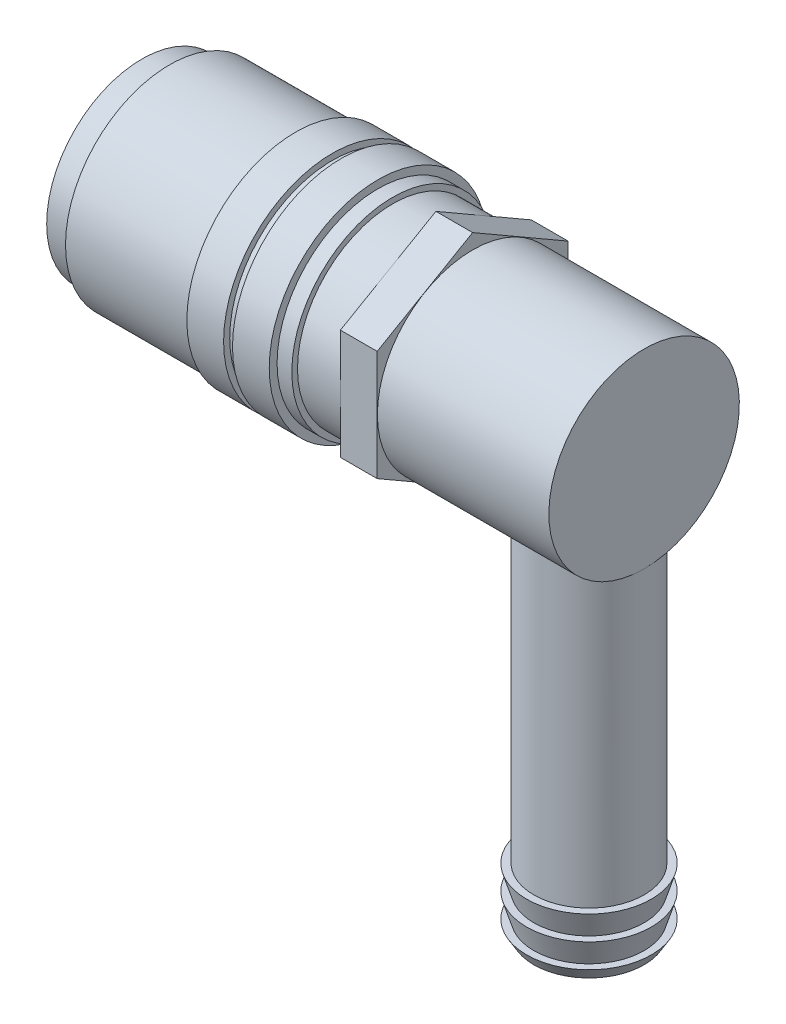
ISO-10303-21;
HEADER;
FILE_DESCRIPTION(('STEP AP214'),'2;1');
FILE_NAME('part.step','',(''),(''),'','','');
FILE_SCHEMA(('AUTOMOTIVE_DESIGN { 1 0 10303 214 1 1 1 1 }'));
ENDSEC;
DATA;
#1=APPLICATION_CONTEXT('core data for automotive mechanical design processes');
#2=APPLICATION_PROTOCOL_DEFINITION('international standard','automotive_design',2000,#1);
#3=PRODUCT_CONTEXT('',#1,'mechanical');
#4=PRODUCT('Part','Part','',(#3));
#5=PRODUCT_RELATED_PRODUCT_CATEGORY('part','',(#4));
#6=PRODUCT_DEFINITION_FORMATION('','',#4);
#7=PRODUCT_DEFINITION_CONTEXT('part definition',#1,'design');
#8=PRODUCT_DEFINITION('design','',#6,#7);
#9=PRODUCT_DEFINITION_SHAPE('','',#8);
#10=(LENGTH_UNIT() NAMED_UNIT(*) SI_UNIT(.MILLI.,.METRE.));
#11=(NAMED_UNIT(*) PLANE_ANGLE_UNIT() SI_UNIT($,.RADIAN.));
#12=(NAMED_UNIT(*) SI_UNIT($,.STERADIAN.) SOLID_ANGLE_UNIT());
#13=UNCERTAINTY_MEASURE_WITH_UNIT(LENGTH_MEASURE(1.E-05),#10,'distance_accuracy_value','');
#14=(GEOMETRIC_REPRESENTATION_CONTEXT(3) GLOBAL_UNCERTAINTY_ASSIGNED_CONTEXT((#13)) GLOBAL_UNIT_ASSIGNED_CONTEXT((#10,
#11,#12)) REPRESENTATION_CONTEXT('',''));
#15=CARTESIAN_POINT('',(0.,0.,0.));
#16=DIRECTION('',(0.,0.,1.));
#17=DIRECTION('',(1.,0.,0.));
#18=AXIS2_PLACEMENT_3D('',#15,#16,#17);
#19=CARTESIAN_POINT('',(41.,0.,0.));
#20=DIRECTION('',(-1.,0.,0.));
#21=DIRECTION('',(0.,0.,1.));
#22=AXIS2_PLACEMENT_3D('',#19,#20,#21);
#23=CYLINDRICAL_SURFACE('',#22,7.77632073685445);
#24=CARTESIAN_POINT('',(27.,0.,0.));
#25=DIRECTION('',(1.,0.,0.));
#26=DIRECTION('',(0.,0.,-1.));
#27=AXIS2_PLACEMENT_3D('',#24,#25,#26);
#28=CIRCLE('',#27,7.77632073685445);
#29=CARTESIAN_POINT('',(27.,0.,-7.77632073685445));
#30=VERTEX_POINT('',#29);
#31=EDGE_CURVE('E172',#30,#30,#28,.T.);
#32=ORIENTED_EDGE('',*,*,#31,.T.);
#33=EDGE_LOOP('',(#32));
#34=FACE_BOUND('',#33,.T.);
#35=CARTESIAN_POINT('',(41.,0.,0.));
#36=DIRECTION('',(1.,0.,0.));
#37=DIRECTION('',(0.,0.,-1.));
#38=AXIS2_PLACEMENT_3D('',#35,#36,#37);
#39=CIRCLE('',#38,7.77632073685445);
#40=CARTESIAN_POINT('',(41.,-7.77632073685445,0.));
#41=VERTEX_POINT('',#40);
#42=EDGE_CURVE('E540',#41,#41,#39,.T.);
#43=ORIENTED_EDGE('',*,*,#42,.F.);
#44=CARTESIAN_POINT('',(41.,-7.77632073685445,0.));
#45=CARTESIAN_POINT('',(40.999998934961,-7.77631977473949,0.115853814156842));
#46=CARTESIAN_POINT('',(40.9955189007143,-7.77372491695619,0.231736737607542));
#47=CARTESIAN_POINT('',(40.9776551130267,-7.76340830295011,0.46263213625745));
#48=CARTESIAN_POINT('',(40.9642662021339,-7.7556835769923,0.577644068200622));
#49=CARTESIAN_POINT('',(40.9287248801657,-7.73527982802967,0.806086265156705));
#50=CARTESIAN_POINT('',(40.9065562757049,-7.72259165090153,0.919513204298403));
#51=CARTESIAN_POINT('',(40.8537448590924,-7.69258051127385,1.14376672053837));
#52=CARTESIAN_POINT('',(40.8230984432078,-7.67525557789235,1.25459217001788));
#53=CARTESIAN_POINT('',(40.7193080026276,-7.61711159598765,1.58089971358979));
#54=CARTESIAN_POINT('',(40.634096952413,-7.56999514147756,1.79156744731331));
#55=CARTESIAN_POINT('',(40.4348503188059,-7.46305401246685,2.19492096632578));
#56=CARTESIAN_POINT('',(40.3208215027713,-7.40323232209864,2.38761095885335));
#57=CARTESIAN_POINT('',(40.0577949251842,-7.27084580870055,2.76566780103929));
#58=CARTESIAN_POINT('',(39.906846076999,-7.19766821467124,2.94946153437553));
#59=CARTESIAN_POINT('',(39.5786013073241,-7.04823240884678,3.29064843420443));
#60=CARTESIAN_POINT('',(39.4012739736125,-6.97197060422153,3.44800964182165));
#61=CARTESIAN_POINT('',(39.0018064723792,-6.81489059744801,3.7497282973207));
#62=CARTESIAN_POINT('',(38.7768709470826,-6.7345204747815,3.89064857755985));
#63=CARTESIAN_POINT('',(38.3018080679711,-6.58915312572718,4.1320927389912));
#64=CARTESIAN_POINT('',(38.051720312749,-6.52413225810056,4.23267891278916));
#65=CARTESIAN_POINT('',(37.5913602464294,-6.43222567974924,4.37068551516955));
#66=CARTESIAN_POINT('',(37.3848899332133,-6.40003924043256,4.41725032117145));
#67=CARTESIAN_POINT('',(36.9654321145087,-6.35566638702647,4.48087479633));
#68=CARTESIAN_POINT('',(36.7524521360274,-6.34345770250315,4.49796732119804));
#69=CARTESIAN_POINT('',(36.3257709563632,-6.34081506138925,4.50169274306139));
#70=CARTESIAN_POINT('',(36.1120691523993,-6.35041383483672,4.48827985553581));
#71=CARTESIAN_POINT('',(35.6905363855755,-6.39001041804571,4.43171154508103));
#72=CARTESIAN_POINT('',(35.4827096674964,-6.42002260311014,4.3885351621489));
#73=CARTESIAN_POINT('',(35.0792815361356,-6.49618983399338,4.27495801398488));
#74=CARTESIAN_POINT('',(34.8836147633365,-6.54224780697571,4.20472069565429));
#75=CARTESIAN_POINT('',(34.506252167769,-6.64553887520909,4.03948570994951));
#76=CARTESIAN_POINT('',(34.3245616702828,-6.70277620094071,3.94447866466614));
#77=CARTESIAN_POINT('',(33.9486873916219,-6.83332750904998,3.71443442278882));
#78=CARTESIAN_POINT('',(33.7573417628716,-6.90773859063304,3.57538753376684));
#79=CARTESIAN_POINT('',(33.3987541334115,-7.05778581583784,3.26922967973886));
#80=CARTESIAN_POINT('',(33.2315335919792,-7.13342298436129,3.10209401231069));
#81=CARTESIAN_POINT('',(32.991963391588,-7.24719145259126,2.82156868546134));
#82=CARTESIAN_POINT('',(32.910210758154,-7.28720070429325,2.71682806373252));
#83=CARTESIAN_POINT('',(32.7558810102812,-7.3644499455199,2.49985575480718));
#84=CARTESIAN_POINT('',(32.6833002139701,-7.4016910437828,2.38762710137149));
#85=CARTESIAN_POINT('',(32.5479662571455,-7.47237623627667,2.15624562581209));
#86=CARTESIAN_POINT('',(32.4852135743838,-7.50582014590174,2.0370924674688));
#87=CARTESIAN_POINT('',(32.3702829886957,-7.56791837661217,1.79266780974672));
#88=CARTESIAN_POINT('',(32.3180986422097,-7.59657561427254,1.66740009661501));
#89=CARTESIAN_POINT('',(32.2281139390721,-7.64649400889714,1.42024662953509));
#90=CARTESIAN_POINT('',(32.1895810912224,-7.66812351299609,1.29870212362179));
#91=CARTESIAN_POINT('',(32.1228383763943,-7.70583864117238,1.05203063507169));
#92=CARTESIAN_POINT('',(32.0946228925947,-7.72192728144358,0.926905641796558));
#93=CARTESIAN_POINT('',(32.0489345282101,-7.74808344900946,0.674164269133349));
#94=CARTESIAN_POINT('',(32.0314551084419,-7.75815464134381,0.546549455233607));
#95=CARTESIAN_POINT('',(32.0075037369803,-7.7719746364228,0.28995603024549));
#96=CARTESIAN_POINT('',(32.0010304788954,-7.77572418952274,0.160977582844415));
#97=CARTESIAN_POINT('',(31.9993113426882,-7.77671945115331,-0.0809010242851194));
#98=CARTESIAN_POINT('',(32.0027606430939,-7.77472102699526,-0.193791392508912));
#99=CARTESIAN_POINT('',(32.0181144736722,-7.76584976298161,-0.418839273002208));
#100=CARTESIAN_POINT('',(32.0300216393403,-7.75897540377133,-0.530996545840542));
#101=CARTESIAN_POINT('',(32.0621385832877,-7.74051704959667,-0.753678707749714));
#102=CARTESIAN_POINT('',(32.0823450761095,-7.72893491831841,-0.864204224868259));
#103=CARTESIAN_POINT('',(32.1308078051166,-7.70133854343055,-1.08292641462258));
#104=CARTESIAN_POINT('',(32.1590671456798,-7.68532259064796,-1.19112217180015));
#105=CARTESIAN_POINT('',(32.2545803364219,-7.63164137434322,-1.5081679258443));
#106=CARTESIAN_POINT('',(32.3330571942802,-7.5880531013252,-1.71276525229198));
#107=CARTESIAN_POINT('',(32.5172147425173,-7.48850898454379,-2.10586441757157));
#108=CARTESIAN_POINT('',(32.6229016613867,-7.43255030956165,-2.2943625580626));
#109=CARTESIAN_POINT('',(32.8708929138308,-7.30609479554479,-2.67125677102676));
#110=CARTESIAN_POINT('',(33.0158663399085,-7.23469044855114,-2.8575926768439));
#111=CARTESIAN_POINT('',(33.3321964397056,-7.08777182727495,-3.2047279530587));
#112=CARTESIAN_POINT('',(33.503583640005,-7.01225286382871,-3.36549733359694));
#113=CARTESIAN_POINT('',(33.8913202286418,-6.85502392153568,-3.67606835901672));
#114=CARTESIAN_POINT('',(34.1105811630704,-6.77361665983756,-3.82241447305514));
#115=CARTESIAN_POINT('',(34.5747839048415,-6.62417161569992,-4.07593509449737));
#116=CARTESIAN_POINT('',(34.8196924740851,-6.5561168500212,-4.18315951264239));
#117=CARTESIAN_POINT('',(35.2748580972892,-6.45631635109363,-4.33515589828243));
#118=CARTESIAN_POINT('',(35.4812592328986,-6.41991149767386,-4.38839523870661));
#119=CARTESIAN_POINT('',(35.9018882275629,-6.36675610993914,-4.4651796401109));
#120=CARTESIAN_POINT('',(36.1161063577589,-6.34998194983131,-4.48876039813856));
#121=CARTESIAN_POINT('',(36.546842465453,-6.33852703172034,-4.50492609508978));
#122=CARTESIAN_POINT('',(36.7633647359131,-6.34389952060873,-4.49743633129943));
#123=CARTESIAN_POINT('',(37.1915683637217,-6.37602791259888,-4.45175932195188));
#124=CARTESIAN_POINT('',(37.4032466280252,-6.40279710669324,-4.41355299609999));
#125=CARTESIAN_POINT('',(37.8110399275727,-6.47306029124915,-4.30980410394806));
#126=CARTESIAN_POINT('',(38.0074092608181,-6.5161282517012,-4.24495453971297));
#127=CARTESIAN_POINT('',(38.3868815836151,-6.61421321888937,-4.09043925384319));
#128=CARTESIAN_POINT('',(38.5699797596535,-6.66923453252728,-4.00076458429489));
#129=CARTESIAN_POINT('',(38.947906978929,-6.79535936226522,-3.78317326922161));
#130=CARTESIAN_POINT('',(39.1401688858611,-6.86763402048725,-3.65148669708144));
#131=CARTESIAN_POINT('',(39.5018206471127,-7.01461013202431,-3.36049976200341));
#132=CARTESIAN_POINT('',(39.6711895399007,-7.08931373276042,-3.20117439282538));
#133=CARTESIAN_POINT('',(39.916377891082,-7.20323911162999,-2.93185345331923));
#134=CARTESIAN_POINT('',(40.0009884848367,-7.2438398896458,-2.8303046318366));
#135=CARTESIAN_POINT('',(40.1613250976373,-7.32267625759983,-2.61958198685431));
#136=CARTESIAN_POINT('',(40.2370544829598,-7.36091274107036,-2.51041107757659));
#137=CARTESIAN_POINT('',(40.3789941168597,-7.43398006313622,-2.28498293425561));
#138=CARTESIAN_POINT('',(40.4452052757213,-7.46881122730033,-2.16872637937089));
#139=CARTESIAN_POINT('',(40.567414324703,-7.53407948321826,-1.9298010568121));
#140=CARTESIAN_POINT('',(40.6234150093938,-7.56451777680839,-1.8071340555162));
#141=CARTESIAN_POINT('',(40.7154800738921,-7.61513208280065,-1.57863161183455));
#142=CARTESIAN_POINT('',(40.753318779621,-7.63617011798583,-1.47369847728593));
#143=CARTESIAN_POINT('',(40.8212559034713,-7.67421811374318,-1.26065135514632));
#144=CARTESIAN_POINT('',(40.8513556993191,-7.69122879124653,-1.1525379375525));
#145=CARTESIAN_POINT('',(40.9034232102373,-7.72080581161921,-0.934049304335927));
#146=CARTESIAN_POINT('',(40.9254100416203,-7.73338259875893,-0.823680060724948));
#147=CARTESIAN_POINT('',(40.9610774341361,-7.75384815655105,-0.601220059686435));
#148=CARTESIAN_POINT('',(40.9747623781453,-7.7617394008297,-0.48913024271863));
#149=CARTESIAN_POINT('',(40.9894696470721,-7.7702307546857,-0.314020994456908));
#150=CARTESIAN_POINT('',(40.9934163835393,-7.77251248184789,-0.251311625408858));
#151=CARTESIAN_POINT('',(40.9986820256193,-7.77555783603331,-0.125737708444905));
#152=CARTESIAN_POINT('',(41.00000057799,-7.77632125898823,-0.0628731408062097));
#153=CARTESIAN_POINT('',(41.,-7.77632073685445,0.));
#154=B_SPLINE_CURVE_WITH_KNOTS('',3,(#44,#45,#46,#47,#48,#49,#50,#51,#52,#53,#54,#55,#56,#57,
#58,#59,#60,#61,#62,#63,#64,#65,#66,#67,#68,#69,#70,#71,#72,#73,#74,#75,#76,#77,#78,#79,#80,#81,
#82,#83,#84,#85,#86,#87,#88,#89,#90,#91,#92,#93,#94,#95,#96,#97,#98,#99,#100,#101,#102,#103,
#104,#105,#106,#107,#108,#109,#110,#111,#112,#113,#114,#115,#116,#117,#118,#119,#120,#121,#122,
#123,#124,#125,#126,#127,#128,#129,#130,#131,#132,#133,#134,#135,#136,#137,#138,#139,#140,#141,
#142,#143,#144,#145,#146,#147,#148,#149,#150,#151,#152,#153),.UNSPECIFIED.,.T.,.F.,(4,2,2,2,2,2,
2,2,2,2,2,2,2,2,2,2,2,2,2,2,2,2,2,2,2,2,2,2,2,2,2,2,2,2,2,2,2,2,2,2,2,2,2,2,2,2,2,2,2,2,2,2,2,2,
4),(0.,0.347496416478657,0.695194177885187,1.04353624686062,1.39202661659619,2.08492763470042,
2.77766608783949,3.52120228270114,4.2656310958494,5.09354091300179,5.92016712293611,
6.55967357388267,7.19846664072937,7.83821908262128,8.4784225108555,9.1148182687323,
9.75145531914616,10.4925049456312,11.2342097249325,11.650043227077,12.0657092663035,
12.4813955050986,12.8968275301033,13.2842554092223,13.6714720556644,14.0584526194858,
14.4453872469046,14.7838526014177,15.1224234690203,15.4608604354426,15.7994280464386,
16.4666722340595,17.1340692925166,17.8710580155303,18.6089049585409,19.4326468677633,
20.2553341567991,20.9013173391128,21.5465222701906,22.1932793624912,22.8404385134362,
23.4717349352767,24.1032591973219,24.8324799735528,25.5623639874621,25.9767457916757,
26.3909700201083,26.8051546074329,27.2192256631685,27.5594112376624,27.8995362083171,
28.2388545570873,28.577993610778,28.7665524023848,28.9551365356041),.UNSPECIFIED.);
#155=EDGE_CURVE('E29',#41,#41,#154,.T.);
#156=ORIENTED_EDGE('',*,*,#155,.F.);
#157=EDGE_LOOP('',(#43,#156));
#158=FACE_BOUND('',#157,.T.);
#159=ADVANCED_FACE('F15',(#34,#158),#23,.T.);
#160=CARTESIAN_POINT('',(0.,0.,0.));
#161=DIRECTION('',(-1.,0.,0.));
#162=DIRECTION('',(0.,0.,1.));
#163=AXIS2_PLACEMENT_3D('',#160,#161,#162);
#164=CYLINDRICAL_SURFACE('',#163,7.77632073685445);
#165=CARTESIAN_POINT('',(0.,0.,0.));
#166=DIRECTION('',(-1.,0.,0.));
#167=DIRECTION('',(0.,0.,1.));
#168=AXIS2_PLACEMENT_3D('',#165,#166,#167);
#169=CIRCLE('',#168,7.77632073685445);
#170=CARTESIAN_POINT('',(0.,0.,7.77632073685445));
#171=VERTEX_POINT('',#170);
#172=EDGE_CURVE('E170',#171,#171,#169,.T.);
#173=ORIENTED_EDGE('',*,*,#172,.F.);
#174=EDGE_LOOP('',(#173));
#175=FACE_BOUND('',#174,.T.);
#176=CARTESIAN_POINT('',(2.26082941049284,0.,0.));
#177=DIRECTION('',(-1.,0.,0.));
#178=DIRECTION('',(0.,0.,1.));
#179=AXIS2_PLACEMENT_3D('',#176,#177,#178);
#180=CIRCLE('',#179,7.77632073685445);
#181=CARTESIAN_POINT('',(2.26082941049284,0.,7.77632073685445));
#182=VERTEX_POINT('',#181);
#183=EDGE_CURVE('E129',#182,#182,#180,.T.);
#184=ORIENTED_EDGE('',*,*,#183,.T.);
#185=EDGE_LOOP('',(#184));
#186=FACE_BOUND('',#185,.T.);
#187=ADVANCED_FACE('F17',(#175,#186),#164,.T.);
#188=CARTESIAN_POINT('',(0.,4.75,0.));
#189=DIRECTION('',(1.,0.,0.));
#190=DIRECTION('',(0.,0.,-1.));
#191=AXIS2_PLACEMENT_3D('',#188,#189,#190);
#192=PLANE('',#191);
#193=CARTESIAN_POINT('',(0.,0.,0.));
#194=DIRECTION('',(-1.,0.,0.));
#195=DIRECTION('',(0.,0.,1.));
#196=AXIS2_PLACEMENT_3D('',#193,#194,#195);
#197=CIRCLE('',#196,4.75);
#198=CARTESIAN_POINT('',(0.,0.,4.75));
#199=VERTEX_POINT('',#198);
#200=EDGE_CURVE('E165',#199,#199,#197,.T.);
#201=ORIENTED_EDGE('',*,*,#200,.F.);
#202=EDGE_LOOP('',(#201));
#203=FACE_BOUND('',#202,.T.);
#204=ORIENTED_EDGE('',*,*,#172,.T.);
#205=EDGE_LOOP('',(#204));
#206=FACE_BOUND('',#205,.T.);
#207=ADVANCED_FACE('F237',(#203,#206),#192,.F.);
#208=CARTESIAN_POINT('',(0.,0.,0.));
#209=DIRECTION('',(-1.,0.,0.));
#210=DIRECTION('',(0.,0.,1.));
#211=AXIS2_PLACEMENT_3D('',#208,#209,#210);
#212=CYLINDRICAL_SURFACE('',#211,4.75);
#213=ORIENTED_EDGE('',*,*,#200,.T.);
#214=EDGE_LOOP('',(#213));
#215=FACE_BOUND('',#214,.T.);
#216=CARTESIAN_POINT('',(27.,0.,0.));
#217=DIRECTION('',(1.,0.,0.));
#218=DIRECTION('',(0.,0.,-1.));
#219=AXIS2_PLACEMENT_3D('',#216,#217,#218);
#220=CIRCLE('',#219,4.75);
#221=CARTESIAN_POINT('',(27.,0.,-4.75));
#222=VERTEX_POINT('',#221);
#223=EDGE_CURVE('E112',#222,#222,#220,.T.);
#224=ORIENTED_EDGE('',*,*,#223,.T.);
#225=EDGE_LOOP('',(#224));
#226=FACE_BOUND('',#225,.T.);
#227=ADVANCED_FACE('F329',(#215,#226),#212,.F.);
#228=CARTESIAN_POINT('',(0.,0.,0.));
#229=DIRECTION('',(-1.,0.,0.));
#230=DIRECTION('',(0.,0.,1.));
#231=AXIS2_PLACEMENT_3D('',#228,#229,#230);
#232=CYLINDRICAL_SURFACE('',#231,7.77632073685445);
#233=CARTESIAN_POINT('',(20.4767230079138,0.,0.));
#234=DIRECTION('',(-1.,0.,0.));
#235=DIRECTION('',(0.,0.,1.));
#236=AXIS2_PLACEMENT_3D('',#233,#234,#235);
#237=CIRCLE('',#236,7.77632073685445);
#238=CARTESIAN_POINT('',(20.4767230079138,0.,7.77632073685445));
#239=VERTEX_POINT('',#238);
#240=EDGE_CURVE('E162',#239,#239,#237,.T.);
#241=ORIENTED_EDGE('',*,*,#240,.F.);
#242=EDGE_LOOP('',(#241));
#243=FACE_BOUND('',#242,.T.);
#244=CARTESIAN_POINT('',(24.,0.,0.));
#245=DIRECTION('',(-1.,0.,0.));
#246=DIRECTION('',(0.,0.,1.));
#247=AXIS2_PLACEMENT_3D('',#244,#245,#246);
#248=CIRCLE('',#247,7.77632073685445);
#249=CARTESIAN_POINT('',(24.,0.,7.77632073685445));
#250=VERTEX_POINT('',#249);
#251=EDGE_CURVE('E128',#250,#250,#248,.T.);
#252=ORIENTED_EDGE('',*,*,#251,.T.);
#253=EDGE_LOOP('',(#252));
#254=FACE_BOUND('',#253,.T.);
#255=ADVANCED_FACE('F336',(#243,#254),#232,.T.);
#256=CARTESIAN_POINT('',(20.4767230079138,8.23838165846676,0.));
#257=DIRECTION('',(-1.,0.,0.));
#258=DIRECTION('',(0.,0.,1.));
#259=AXIS2_PLACEMENT_3D('',#256,#257,#258);
#260=PLANE('',#259);
#261=CARTESIAN_POINT('',(20.4767230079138,0.,0.));
#262=DIRECTION('',(-1.,0.,0.));
#263=DIRECTION('',(0.,0.,1.));
#264=AXIS2_PLACEMENT_3D('',#261,#262,#263);
#265=CIRCLE('',#264,8.23838165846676);
#266=CARTESIAN_POINT('',(20.4767230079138,0.,8.23838165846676));
#267=VERTEX_POINT('',#266);
#268=EDGE_CURVE('E159',#267,#267,#265,.T.);
#269=ORIENTED_EDGE('',*,*,#268,.F.);
#270=EDGE_LOOP('',(#269));
#271=FACE_BOUND('',#270,.T.);
#272=ORIENTED_EDGE('',*,*,#240,.T.);
#273=EDGE_LOOP('',(#272));
#274=FACE_BOUND('',#273,.T.);
#275=ADVANCED_FACE('F345',(#271,#274),#260,.F.);
#276=CARTESIAN_POINT('',(0.,0.,0.));
#277=DIRECTION('',(-1.,0.,0.));
#278=DIRECTION('',(0.,0.,1.));
#279=AXIS2_PLACEMENT_3D('',#276,#277,#278);
#280=CYLINDRICAL_SURFACE('',#279,8.23838165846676);
#281=CARTESIAN_POINT('',(19.2715238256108,0.,0.));
#282=DIRECTION('',(-1.,0.,0.));
#283=DIRECTION('',(0.,0.,1.));
#284=AXIS2_PLACEMENT_3D('',#281,#282,#283);
#285=CIRCLE('',#284,8.23838165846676);
#286=CARTESIAN_POINT('',(19.2715238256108,0.,8.23838165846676));
#287=VERTEX_POINT('',#286);
#288=EDGE_CURVE('E156',#287,#287,#285,.T.);
#289=ORIENTED_EDGE('',*,*,#288,.F.);
#290=EDGE_LOOP('',(#289));
#291=FACE_BOUND('',#290,.T.);
#292=ORIENTED_EDGE('',*,*,#268,.T.);
#293=EDGE_LOOP('',(#292));
#294=FACE_BOUND('',#293,.T.);
#295=ADVANCED_FACE('F354',(#291,#294),#280,.T.);
#296=CARTESIAN_POINT('',(19.2715238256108,8.8782970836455,0.));
#297=DIRECTION('',(-1.,0.,0.));
#298=DIRECTION('',(0.,0.,1.));
#299=AXIS2_PLACEMENT_3D('',#296,#297,#298);
#300=PLANE('',#299);
#301=CARTESIAN_POINT('',(19.2715238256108,0.,0.));
#302=DIRECTION('',(-1.,0.,0.));
#303=DIRECTION('',(0.,0.,1.));
#304=AXIS2_PLACEMENT_3D('',#301,#302,#303);
#305=CIRCLE('',#304,8.8782970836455);
#306=CARTESIAN_POINT('',(19.2715238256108,0.,8.8782970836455));
#307=VERTEX_POINT('',#306);
#308=EDGE_CURVE('E153',#307,#307,#305,.T.);
#309=ORIENTED_EDGE('',*,*,#308,.F.);
#310=EDGE_LOOP('',(#309));
#311=FACE_BOUND('',#310,.T.);
#312=ORIENTED_EDGE('',*,*,#288,.T.);
#313=EDGE_LOOP('',(#312));
#314=FACE_BOUND('',#313,.T.);
#315=ADVANCED_FACE('F363',(#311,#314),#300,.F.);
#316=CARTESIAN_POINT('',(0.,0.,0.));
#317=DIRECTION('',(-1.,0.,0.));
#318=DIRECTION('',(0.,0.,1.));
#319=AXIS2_PLACEMENT_3D('',#316,#317,#318);
#320=CYLINDRICAL_SURFACE('',#319,8.8782970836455);
#321=CARTESIAN_POINT('',(16.2715238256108,0.,0.));
#322=DIRECTION('',(-1.,0.,0.));
#323=DIRECTION('',(0.,0.,1.));
#324=AXIS2_PLACEMENT_3D('',#321,#322,#323);
#325=CIRCLE('',#324,8.8782970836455);
#326=CARTESIAN_POINT('',(16.2715238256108,0.,8.8782970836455));
#327=VERTEX_POINT('',#326);
#328=EDGE_CURVE('E150',#327,#327,#325,.T.);
#329=ORIENTED_EDGE('',*,*,#328,.F.);
#330=EDGE_LOOP('',(#329));
#331=FACE_BOUND('',#330,.T.);
#332=ORIENTED_EDGE('',*,*,#308,.T.);
#333=EDGE_LOOP('',(#332));
#334=FACE_BOUND('',#333,.T.);
#335=ADVANCED_FACE('F372',(#331,#334),#320,.T.);
#336=CARTESIAN_POINT('',(16.2715238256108,8.3782970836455,0.));
#337=DIRECTION('',(1.,0.,0.));
#338=DIRECTION('',(0.,0.,-1.));
#339=AXIS2_PLACEMENT_3D('',#336,#337,#338);
#340=PLANE('',#339);
#341=CARTESIAN_POINT('',(16.2715238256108,0.,0.));
#342=DIRECTION('',(-1.,0.,0.));
#343=DIRECTION('',(0.,0.,1.));
#344=AXIS2_PLACEMENT_3D('',#341,#342,#343);
#345=CIRCLE('',#344,8.3782970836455);
#346=CARTESIAN_POINT('',(16.2715238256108,0.,8.3782970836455));
#347=VERTEX_POINT('',#346);
#348=EDGE_CURVE('E147',#347,#347,#345,.T.);
#349=ORIENTED_EDGE('',*,*,#348,.F.);
#350=EDGE_LOOP('',(#349));
#351=FACE_BOUND('',#350,.T.);
#352=ORIENTED_EDGE('',*,*,#328,.T.);
#353=EDGE_LOOP('',(#352));
#354=FACE_BOUND('',#353,.T.);
#355=ADVANCED_FACE('F381',(#351,#354),#340,.F.);
#356=CARTESIAN_POINT('',(0.,0.,0.));
#357=DIRECTION('',(-1.,0.,0.));
#358=DIRECTION('',(0.,0.,1.));
#359=AXIS2_PLACEMENT_3D('',#356,#357,#358);
#360=CYLINDRICAL_SURFACE('',#359,8.3782970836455);
#361=CARTESIAN_POINT('',(15.5455682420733,0.,0.));
#362=DIRECTION('',(-1.,0.,0.));
#363=DIRECTION('',(0.,0.,1.));
#364=AXIS2_PLACEMENT_3D('',#361,#362,#363);
#365=CIRCLE('',#364,8.3782970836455);
#366=CARTESIAN_POINT('',(15.5455682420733,0.,8.3782970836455));
#367=VERTEX_POINT('',#366);
#368=EDGE_CURVE('E144',#367,#367,#365,.T.);
#369=ORIENTED_EDGE('',*,*,#368,.F.);
#370=EDGE_LOOP('',(#369));
#371=FACE_BOUND('',#370,.T.);
#372=ORIENTED_EDGE('',*,*,#348,.T.);
#373=EDGE_LOOP('',(#372));
#374=FACE_BOUND('',#373,.T.);
#375=ADVANCED_FACE('F390',(#371,#374),#360,.T.);
#376=CARTESIAN_POINT('',(15.5455682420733,8.8782970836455,0.));
#377=DIRECTION('',(-1.,0.,0.));
#378=DIRECTION('',(0.,0.,1.));
#379=AXIS2_PLACEMENT_3D('',#376,#377,#378);
#380=PLANE('',#379);
#381=CARTESIAN_POINT('',(15.5455682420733,0.,0.));
#382=DIRECTION('',(-1.,0.,0.));
#383=DIRECTION('',(0.,0.,1.));
#384=AXIS2_PLACEMENT_3D('',#381,#382,#383);
#385=CIRCLE('',#384,8.8782970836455);
#386=CARTESIAN_POINT('',(15.5455682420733,0.,8.8782970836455));
#387=VERTEX_POINT('',#386);
#388=EDGE_CURVE('E141',#387,#387,#385,.T.);
#389=ORIENTED_EDGE('',*,*,#388,.F.);
#390=EDGE_LOOP('',(#389));
#391=FACE_BOUND('',#390,.T.);
#392=ORIENTED_EDGE('',*,*,#368,.T.);
#393=EDGE_LOOP('',(#392));
#394=FACE_BOUND('',#393,.T.);
#395=ADVANCED_FACE('F399',(#391,#394),#380,.F.);
#396=CARTESIAN_POINT('',(0.,0.,0.));
#397=DIRECTION('',(-1.,0.,0.));
#398=DIRECTION('',(0.,0.,1.));
#399=AXIS2_PLACEMENT_3D('',#396,#397,#398);
#400=CYLINDRICAL_SURFACE('',#399,8.8782970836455);
#401=CARTESIAN_POINT('',(12.5455682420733,0.,0.));
#402=DIRECTION('',(-1.,0.,0.));
#403=DIRECTION('',(0.,0.,1.));
#404=AXIS2_PLACEMENT_3D('',#401,#402,#403);
#405=CIRCLE('',#404,8.8782970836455);
#406=CARTESIAN_POINT('',(12.5455682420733,0.,8.8782970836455));
#407=VERTEX_POINT('',#406);
#408=EDGE_CURVE('E138',#407,#407,#405,.T.);
#409=ORIENTED_EDGE('',*,*,#408,.F.);
#410=EDGE_LOOP('',(#409));
#411=FACE_BOUND('',#410,.T.);
#412=ORIENTED_EDGE('',*,*,#388,.T.);
#413=EDGE_LOOP('',(#412));
#414=FACE_BOUND('',#413,.T.);
#415=ADVANCED_FACE('F408',(#411,#414),#400,.T.);
#416=CARTESIAN_POINT('',(12.5455682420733,8.5,0.));
#417=DIRECTION('',(1.,0.,0.));
#418=DIRECTION('',(0.,0.,-1.));
#419=AXIS2_PLACEMENT_3D('',#416,#417,#418);
#420=PLANE('',#419);
#421=CARTESIAN_POINT('',(12.5455682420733,0.,0.));
#422=DIRECTION('',(-1.,0.,0.));
#423=DIRECTION('',(0.,0.,1.));
#424=AXIS2_PLACEMENT_3D('',#421,#422,#423);
#425=CIRCLE('',#424,8.5);
#426=CARTESIAN_POINT('',(12.5455682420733,0.,8.5));
#427=VERTEX_POINT('',#426);
#428=EDGE_CURVE('E135',#427,#427,#425,.T.);
#429=ORIENTED_EDGE('',*,*,#428,.F.);
#430=EDGE_LOOP('',(#429));
#431=FACE_BOUND('',#430,.T.);
#432=ORIENTED_EDGE('',*,*,#408,.T.);
#433=EDGE_LOOP('',(#432));
#434=FACE_BOUND('',#433,.T.);
#435=ADVANCED_FACE('F417',(#431,#434),#420,.F.);
#436=CARTESIAN_POINT('',(0.,0.,0.));
#437=DIRECTION('',(-1.,0.,0.));
#438=DIRECTION('',(0.,0.,1.));
#439=AXIS2_PLACEMENT_3D('',#436,#437,#438);
#440=CYLINDRICAL_SURFACE('',#439,8.5);
#441=CARTESIAN_POINT('',(2.26082941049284,0.,0.));
#442=DIRECTION('',(-1.,0.,0.));
#443=DIRECTION('',(0.,0.,1.));
#444=AXIS2_PLACEMENT_3D('',#441,#442,#443);
#445=CIRCLE('',#444,8.5);
#446=CARTESIAN_POINT('',(2.26082941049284,0.,8.5));
#447=VERTEX_POINT('',#446);
#448=EDGE_CURVE('E132',#447,#447,#445,.T.);
#449=ORIENTED_EDGE('',*,*,#448,.F.);
#450=EDGE_LOOP('',(#449));
#451=FACE_BOUND('',#450,.T.);
#452=ORIENTED_EDGE('',*,*,#428,.T.);
#453=EDGE_LOOP('',(#452));
#454=FACE_BOUND('',#453,.T.);
#455=ADVANCED_FACE('F426',(#451,#454),#440,.T.);
#456=CARTESIAN_POINT('',(2.26082941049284,7.77632073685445,0.));
#457=DIRECTION('',(1.,0.,0.));
#458=DIRECTION('',(0.,0.,-1.));
#459=AXIS2_PLACEMENT_3D('',#456,#457,#458);
#460=PLANE('',#459);
#461=ORIENTED_EDGE('',*,*,#183,.F.);
#462=EDGE_LOOP('',(#461));
#463=FACE_BOUND('',#462,.T.);
#464=ORIENTED_EDGE('',*,*,#448,.T.);
#465=EDGE_LOOP('',(#464));
#466=FACE_BOUND('',#465,.T.);
#467=ADVANCED_FACE('F435',(#463,#466),#460,.F.);
#468=CARTESIAN_POINT('',(27.,0.,0.));
#469=DIRECTION('',(1.,0.,0.));
#470=DIRECTION('',(0.,0.,-1.));
#471=AXIS2_PLACEMENT_3D('',#468,#469,#470);
#472=PLANE('',#471);
#473=ORIENTED_EDGE('',*,*,#31,.F.);
#474=EDGE_LOOP('',(#473));
#475=FACE_BOUND('',#474,.T.);
#476=DIRECTION('',(0.,0.5,0.866025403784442));
#477=VECTOR('',#476,1.);
#478=CARTESIAN_POINT('',(27.,4.50000000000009,-7.7942286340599));
#479=LINE('',#478,#477);
#480=CARTESIAN_POINT('',(27.,4.50000000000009,-7.7942286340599));
#481=VERTEX_POINT('',#480);
#482=CARTESIAN_POINT('',(27.,9.,0.));
#483=VERTEX_POINT('',#482);
#484=EDGE_CURVE('E119',#481,#483,#479,.T.);
#485=ORIENTED_EDGE('',*,*,#484,.T.);
#486=DIRECTION('',(0.,-0.5,0.866025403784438));
#487=VECTOR('',#486,1.);
#488=CARTESIAN_POINT('',(27.,9.,0.));
#489=LINE('',#488,#487);
#490=CARTESIAN_POINT('',(27.,4.5,7.79422863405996));
#491=VERTEX_POINT('',#490);
#492=EDGE_CURVE('E76',#483,#491,#489,.T.);
#493=ORIENTED_EDGE('',*,*,#492,.T.);
#494=DIRECTION('',(0.,-1.,0.));
#495=VECTOR('',#494,1.);
#496=CARTESIAN_POINT('',(27.,4.5,7.79422863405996));
#497=LINE('',#496,#495);
#498=CARTESIAN_POINT('',(27.,-4.5,7.79422863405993));
#499=VERTEX_POINT('',#498);
#500=EDGE_CURVE('E90',#491,#499,#497,.T.);
#501=ORIENTED_EDGE('',*,*,#500,.T.);
#502=DIRECTION('',(0.,-0.5,-0.866025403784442));
#503=VECTOR('',#502,1.);
#504=CARTESIAN_POINT('',(27.,-4.5,7.79422863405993));
#505=LINE('',#504,#503);
#506=CARTESIAN_POINT('',(27.,-9.,0.));
#507=VERTEX_POINT('',#506);
#508=EDGE_CURVE('E84',#499,#507,#505,.T.);
#509=ORIENTED_EDGE('',*,*,#508,.T.);
#510=DIRECTION('',(0.,0.500000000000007,-0.866025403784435));
#511=VECTOR('',#510,1.);
#512=CARTESIAN_POINT('',(27.,-9.,0.));
#513=LINE('',#512,#511);
#514=CARTESIAN_POINT('',(27.,-4.49999999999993,-7.79422863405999));
#515=VERTEX_POINT('',#514);
#516=EDGE_CURVE('E88',#507,#515,#513,.T.);
#517=ORIENTED_EDGE('',*,*,#516,.T.);
#518=DIRECTION('',(0.,1.,0.));
#519=VECTOR('',#518,1.);
#520=CARTESIAN_POINT('',(27.,-4.49999999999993,-7.79422863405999));
#521=LINE('',#520,#519);
#522=EDGE_CURVE('E37',#515,#481,#521,.T.);
#523=ORIENTED_EDGE('',*,*,#522,.T.);
#524=EDGE_LOOP('',(#485,#493,#501,#509,#517,#523));
#525=FACE_BOUND('',#524,.T.);
#526=ADVANCED_FACE('F86',(#475,#525),#472,.T.);
#527=CARTESIAN_POINT('',(24.,0.,0.));
#528=DIRECTION('',(1.,0.,0.));
#529=DIRECTION('',(0.,0.,-1.));
#530=AXIS2_PLACEMENT_3D('',#527,#528,#529);
#531=PLANE('',#530);
#532=ORIENTED_EDGE('',*,*,#251,.F.);
#533=EDGE_LOOP('',(#532));
#534=FACE_BOUND('',#533,.T.);
#535=DIRECTION('',(0.,0.5,0.866025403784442));
#536=VECTOR('',#535,1.);
#537=CARTESIAN_POINT('',(24.,4.50000000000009,-7.7942286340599));
#538=LINE('',#537,#536);
#539=CARTESIAN_POINT('',(24.,4.50000000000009,-7.7942286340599));
#540=VERTEX_POINT('',#539);
#541=CARTESIAN_POINT('',(24.,9.,0.));
#542=VERTEX_POINT('',#541);
#543=EDGE_CURVE('E108',#540,#542,#538,.T.);
#544=ORIENTED_EDGE('',*,*,#543,.F.);
#545=DIRECTION('',(0.,1.,0.));
#546=VECTOR('',#545,1.);
#547=CARTESIAN_POINT('',(24.,-4.49999999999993,-7.79422863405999));
#548=LINE('',#547,#546);
#549=CARTESIAN_POINT('',(24.,-4.49999999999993,-7.79422863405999));
#550=VERTEX_POINT('',#549);
#551=EDGE_CURVE('E67',#550,#540,#548,.T.);
#552=ORIENTED_EDGE('',*,*,#551,.F.);
#553=DIRECTION('',(0.,0.500000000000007,-0.866025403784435));
#554=VECTOR('',#553,1.);
#555=CARTESIAN_POINT('',(24.,-9.,0.));
#556=LINE('',#555,#554);
#557=CARTESIAN_POINT('',(24.,-9.,0.));
#558=VERTEX_POINT('',#557);
#559=EDGE_CURVE('E61',#558,#550,#556,.T.);
#560=ORIENTED_EDGE('',*,*,#559,.F.);
#561=DIRECTION('',(0.,-0.5,-0.866025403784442));
#562=VECTOR('',#561,1.);
#563=CARTESIAN_POINT('',(24.,-4.5,7.79422863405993));
#564=LINE('',#563,#562);
#565=CARTESIAN_POINT('',(24.,-4.5,7.79422863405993));
#566=VERTEX_POINT('',#565);
#567=EDGE_CURVE('E98',#566,#558,#564,.T.);
#568=ORIENTED_EDGE('',*,*,#567,.F.);
#569=DIRECTION('',(0.,-1.,0.));
#570=VECTOR('',#569,1.);
#571=CARTESIAN_POINT('',(24.,4.5,7.79422863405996));
#572=LINE('',#571,#570);
#573=CARTESIAN_POINT('',(24.,4.5,7.79422863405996));
#574=VERTEX_POINT('',#573);
#575=EDGE_CURVE('E114',#574,#566,#572,.T.);
#576=ORIENTED_EDGE('',*,*,#575,.F.);
#577=DIRECTION('',(0.,-0.5,0.866025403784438));
#578=VECTOR('',#577,1.);
#579=CARTESIAN_POINT('',(24.,9.,0.));
#580=LINE('',#579,#578);
#581=EDGE_CURVE('E111',#542,#574,#580,.T.);
#582=ORIENTED_EDGE('',*,*,#581,.F.);
#583=EDGE_LOOP('',(#544,#552,#560,#568,#576,#582));
#584=FACE_BOUND('',#583,.T.);
#585=ADVANCED_FACE('F452',(#534,#584),#531,.F.);
#586=CARTESIAN_POINT('',(27.,4.50000000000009,-7.7942286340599));
#587=DIRECTION('',(0.,-0.866025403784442,0.5));
#588=DIRECTION('',(0.,-0.5,-0.866025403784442));
#589=AXIS2_PLACEMENT_3D('',#586,#587,#588);
#590=PLANE('',#589);
#591=ORIENTED_EDGE('',*,*,#543,.T.);
#592=DIRECTION('',(-1.,0.,0.));
#593=VECTOR('',#592,1.);
#594=CARTESIAN_POINT('',(27.,9.,0.));
#595=LINE('',#594,#593);
#596=EDGE_CURVE('E126',#483,#542,#595,.T.);
#597=ORIENTED_EDGE('',*,*,#596,.F.);
#598=ORIENTED_EDGE('',*,*,#484,.F.);
#599=DIRECTION('',(-1.,0.,0.));
#600=VECTOR('',#599,1.);
#601=CARTESIAN_POINT('',(27.,4.50000000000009,-7.7942286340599));
#602=LINE('',#601,#600);
#603=EDGE_CURVE('E104',#481,#540,#602,.T.);
#604=ORIENTED_EDGE('',*,*,#603,.T.);
#605=EDGE_LOOP('',(#591,#597,#598,#604));
#606=FACE_BOUND('',#605,.T.);
#607=ADVANCED_FACE('F460',(#606),#590,.F.);
#608=CARTESIAN_POINT('',(27.,9.,0.));
#609=DIRECTION('',(0.,-0.866025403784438,-0.5));
#610=DIRECTION('',(0.,0.5,-0.866025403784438));
#611=AXIS2_PLACEMENT_3D('',#608,#609,#610);
#612=PLANE('',#611);
#613=ORIENTED_EDGE('',*,*,#581,.T.);
#614=DIRECTION('',(-1.,0.,0.));
#615=VECTOR('',#614,1.);
#616=CARTESIAN_POINT('',(27.,4.5,7.79422863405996));
#617=LINE('',#616,#615);
#618=EDGE_CURVE('E123',#491,#574,#617,.T.);
#619=ORIENTED_EDGE('',*,*,#618,.F.);
#620=ORIENTED_EDGE('',*,*,#492,.F.);
#621=ORIENTED_EDGE('',*,*,#596,.T.);
#622=EDGE_LOOP('',(#613,#619,#620,#621));
#623=FACE_BOUND('',#622,.T.);
#624=ADVANCED_FACE('F469',(#623),#612,.F.);
#625=CARTESIAN_POINT('',(27.,4.5,7.79422863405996));
#626=DIRECTION('',(0.,0.,-1.));
#627=DIRECTION('',(0.,1.,0.));
#628=AXIS2_PLACEMENT_3D('',#625,#626,#627);
#629=PLANE('',#628);
#630=ORIENTED_EDGE('',*,*,#575,.T.);
#631=DIRECTION('',(-1.,0.,0.));
#632=VECTOR('',#631,1.);
#633=CARTESIAN_POINT('',(27.,-4.5,7.79422863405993));
#634=LINE('',#633,#632);
#635=EDGE_CURVE('E99',#499,#566,#634,.T.);
#636=ORIENTED_EDGE('',*,*,#635,.F.);
#637=ORIENTED_EDGE('',*,*,#500,.F.);
#638=ORIENTED_EDGE('',*,*,#618,.T.);
#639=EDGE_LOOP('',(#630,#636,#637,#638));
#640=FACE_BOUND('',#639,.T.);
#641=ADVANCED_FACE('F478',(#640),#629,.F.);
#642=CARTESIAN_POINT('',(27.,-4.5,7.79422863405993));
#643=DIRECTION('',(0.,0.866025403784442,-0.5));
#644=DIRECTION('',(0.,0.5,0.866025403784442));
#645=AXIS2_PLACEMENT_3D('',#642,#643,#644);
#646=PLANE('',#645);
#647=ORIENTED_EDGE('',*,*,#567,.T.);
#648=DIRECTION('',(-1.,0.,0.));
#649=VECTOR('',#648,1.);
#650=CARTESIAN_POINT('',(27.,-9.,0.));
#651=LINE('',#650,#649);
#652=EDGE_CURVE('E95',#507,#558,#651,.T.);
#653=ORIENTED_EDGE('',*,*,#652,.F.);
#654=ORIENTED_EDGE('',*,*,#508,.F.);
#655=ORIENTED_EDGE('',*,*,#635,.T.);
#656=EDGE_LOOP('',(#647,#653,#654,#655));
#657=FACE_BOUND('',#656,.T.);
#658=ADVANCED_FACE('F96',(#657),#646,.F.);
#659=CARTESIAN_POINT('',(27.,-9.,0.));
#660=DIRECTION('',(0.,0.866025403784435,0.500000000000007));
#661=DIRECTION('',(0.,-0.500000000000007,0.866025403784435));
#662=AXIS2_PLACEMENT_3D('',#659,#660,#661);
#663=PLANE('',#662);
#664=ORIENTED_EDGE('',*,*,#559,.T.);
#665=DIRECTION('',(-1.,0.,0.));
#666=VECTOR('',#665,1.);
#667=CARTESIAN_POINT('',(27.,-4.49999999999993,-7.79422863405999));
#668=LINE('',#667,#666);
#669=EDGE_CURVE('E100',#515,#550,#668,.T.);
#670=ORIENTED_EDGE('',*,*,#669,.F.);
#671=ORIENTED_EDGE('',*,*,#516,.F.);
#672=ORIENTED_EDGE('',*,*,#652,.T.);
#673=EDGE_LOOP('',(#664,#670,#671,#672));
#674=FACE_BOUND('',#673,.T.);
#675=ADVANCED_FACE('F102',(#674),#663,.F.);
#676=CARTESIAN_POINT('',(27.,-4.49999999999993,-7.79422863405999));
#677=DIRECTION('',(0.,0.,1.));
#678=DIRECTION('',(0.,-1.,0.));
#679=AXIS2_PLACEMENT_3D('',#676,#677,#678);
#680=PLANE('',#679);
#681=ORIENTED_EDGE('',*,*,#551,.T.);
#682=ORIENTED_EDGE('',*,*,#603,.F.);
#683=ORIENTED_EDGE('',*,*,#522,.F.);
#684=ORIENTED_EDGE('',*,*,#669,.T.);
#685=EDGE_LOOP('',(#681,#682,#683,#684));
#686=FACE_BOUND('',#685,.T.);
#687=ADVANCED_FACE('F222',(#686),#680,.F.);
#688=CARTESIAN_POINT('',(41.,0.,0.));
#689=DIRECTION('',(1.,0.,0.));
#690=DIRECTION('',(0.,0.,-1.));
#691=AXIS2_PLACEMENT_3D('',#688,#689,#690);
#692=PLANE('',#691);
#693=ORIENTED_EDGE('',*,*,#42,.T.);
#694=EDGE_LOOP('',(#693));
#695=FACE_BOUND('',#694,.T.);
#696=ADVANCED_FACE('F220',(#695),#692,.T.);
#697=CARTESIAN_POINT('',(27.,0.,0.));
#698=DIRECTION('',(1.,0.,0.));
#699=DIRECTION('',(0.,0.,-1.));
#700=AXIS2_PLACEMENT_3D('',#697,#698,#699);
#701=PLANE('',#700);
#702=ORIENTED_EDGE('',*,*,#223,.F.);
#703=EDGE_LOOP('',(#702));
#704=FACE_BOUND('',#703,.T.);
#705=ADVANCED_FACE('F218',(#704),#701,.F.);
#706=CARTESIAN_POINT('',(36.5,-7.77632073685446,0.));
#707=DIRECTION('',(0.,1.,0.));
#708=DIRECTION('',(0.,0.,1.));
#709=AXIS2_PLACEMENT_3D('',#706,#707,#708);
#710=CYLINDRICAL_SURFACE('',#709,3.);
#711=CARTESIAN_POINT('',(36.5,-35.7763207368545,0.));
#712=DIRECTION('',(0.,1.,0.));
#713=DIRECTION('',(0.,0.,1.));
#714=AXIS2_PLACEMENT_3D('',#711,#712,#713);
#715=CIRCLE('',#714,3.);
#716=CARTESIAN_POINT('',(36.5,-35.7763207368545,3.));
#717=VERTEX_POINT('',#716);
#718=EDGE_CURVE('E544',#717,#717,#715,.T.);
#719=ORIENTED_EDGE('',*,*,#718,.F.);
#720=EDGE_LOOP('',(#719));
#721=FACE_BOUND('',#720,.T.);
#722=CARTESIAN_POINT('',(36.5,-7.17434068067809,3.));
#723=CARTESIAN_POINT('',(36.6615118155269,-7.1743514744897,2.99998845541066));
#724=CARTESIAN_POINT('',(36.8231708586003,-7.17986643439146,2.98689023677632));
#725=CARTESIAN_POINT('',(37.1414892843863,-7.20120536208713,2.93505461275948));
#726=CARTESIAN_POINT('',(37.2981490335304,-7.21702857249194,2.89631909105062));
#727=CARTESIAN_POINT('',(37.6019091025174,-7.2569093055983,2.7948828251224));
#728=CARTESIAN_POINT('',(37.7490324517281,-7.28094603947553,2.73224253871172));
#729=CARTESIAN_POINT('',(38.030732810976,-7.33451672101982,2.58498466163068));
#730=CARTESIAN_POINT('',(38.1653058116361,-7.36405241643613,2.50036008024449));
#731=CARTESIAN_POINT('',(38.4251834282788,-7.42703386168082,2.30676422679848));
#732=CARTESIAN_POINT('',(38.5497351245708,-7.46059914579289,2.19682076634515));
#733=CARTESIAN_POINT('',(38.7791677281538,-7.52686417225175,1.9577670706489));
#734=CARTESIAN_POINT('',(38.8840441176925,-7.5595637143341,1.82865244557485));
#735=CARTESIAN_POINT('',(39.0748371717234,-7.62184428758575,1.54914736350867));
#736=CARTESIAN_POINT('',(39.159927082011,-7.65126896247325,1.39815458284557));
#737=CARTESIAN_POINT('',(39.3031816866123,-7.70223924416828,1.08266032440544));
#738=CARTESIAN_POINT('',(39.3613563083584,-7.7237877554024,0.91816385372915));
#739=CARTESIAN_POINT('',(39.44646322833,-7.75572843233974,0.588254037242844));
#740=CARTESIAN_POINT('',(39.4746937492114,-7.76658258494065,0.423221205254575));
#741=CARTESIAN_POINT('',(39.5032795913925,-7.77757458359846,0.0904272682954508));
#742=CARTESIAN_POINT('',(39.5036445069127,-7.7777161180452,-0.0773328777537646));
#743=CARTESIAN_POINT('',(39.4772259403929,-7.76755536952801,-0.401481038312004));
#744=CARTESIAN_POINT('',(39.4518616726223,-7.75779904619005,-0.558004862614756));
#745=CARTESIAN_POINT('',(39.3771033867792,-7.72966331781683,-0.864375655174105));
#746=CARTESIAN_POINT('',(39.3277076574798,-7.71128329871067,-1.01422214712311));
#747=CARTESIAN_POINT('',(39.2056733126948,-7.66736948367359,-1.30562714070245));
#748=CARTESIAN_POINT('',(39.1327013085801,-7.64173377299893,-1.44703003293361));
#749=CARTESIAN_POINT('',(38.9658878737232,-7.58588155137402,-1.71594141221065));
#750=CARTESIAN_POINT('',(38.872039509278,-7.55566351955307,-1.84344526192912));
#751=CARTESIAN_POINT('',(38.6593908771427,-7.49154495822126,-2.08926784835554));
#752=CARTESIAN_POINT('',(38.5394100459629,-7.45753224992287,-2.20653763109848));
#753=CARTESIAN_POINT('',(38.2813105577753,-7.39112300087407,-2.41970210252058));
#754=CARTESIAN_POINT('',(38.1431868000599,-7.35872691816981,-2.51559075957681));
#755=CARTESIAN_POINT('',(37.8483510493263,-7.29848787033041,-2.68543968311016));
#756=CARTESIAN_POINT('',(37.691264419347,-7.27077701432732,-2.75880032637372));
#757=CARTESIAN_POINT('',(37.365614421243,-7.22458111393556,-2.87762136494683));
#758=CARTESIAN_POINT('',(37.1970579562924,-7.20609057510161,-2.92309838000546));
#759=CARTESIAN_POINT('',(36.8636640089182,-7.18174072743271,-2.98240497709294));
#760=CARTESIAN_POINT('',(36.6991739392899,-7.1752136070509,-2.99791059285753));
#761=CARTESIAN_POINT('',(36.3698487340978,-7.17363376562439,-3.00169238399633));
#762=CARTESIAN_POINT('',(36.2050137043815,-7.17857792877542,-2.98997595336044));
#763=CARTESIAN_POINT('',(35.8885697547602,-7.1987022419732,-2.94116876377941));
#764=CARTESIAN_POINT('',(35.7367165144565,-7.21334315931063,-2.9054133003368));
#765=CARTESIAN_POINT('',(35.4412471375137,-7.25055926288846,-2.81124512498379));
#766=CARTESIAN_POINT('',(35.2976327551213,-7.27313613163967,-2.75282760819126));
#767=CARTESIAN_POINT('',(35.0165048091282,-7.32475699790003,-2.61244771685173));
#768=CARTESIAN_POINT('',(34.8794451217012,-7.35401819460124,-2.52965868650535));
#769=CARTESIAN_POINT('',(34.6205715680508,-7.41536026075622,-2.34375047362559));
#770=CARTESIAN_POINT('',(34.4987635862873,-7.44744221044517,-2.24062348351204));
#771=CARTESIAN_POINT('',(34.2652781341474,-7.51343822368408,-2.00870261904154));
#772=CARTESIAN_POINT('',(34.1548471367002,-7.54732905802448,-1.8786427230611));
#773=CARTESIAN_POINT('',(33.957209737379,-7.61105623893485,-1.60101415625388));
#774=CARTESIAN_POINT('',(33.8700037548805,-7.64089251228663,-1.453445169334));
#775=CARTESIAN_POINT('',(33.7217689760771,-7.69317345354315,-1.14483849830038));
#776=CARTESIAN_POINT('',(33.6606828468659,-7.71563428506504,-0.983831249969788));
#777=CARTESIAN_POINT('',(33.5668319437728,-7.75065946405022,-0.652754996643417));
#778=CARTESIAN_POINT('',(33.5340529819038,-7.76322876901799,-0.482690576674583));
#779=CARTESIAN_POINT('',(33.4993426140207,-7.77655959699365,-0.149561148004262));
#780=CARTESIAN_POINT('',(33.4956440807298,-7.77799745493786,0.0132942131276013));
#781=CARTESIAN_POINT('',(33.5146026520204,-7.77069384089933,0.337213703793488));
#782=CARTESIAN_POINT('',(33.5372562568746,-7.76195372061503,0.498278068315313));
#783=CARTESIAN_POINT('',(33.6070238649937,-7.73559803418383,0.809606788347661));
#784=CARTESIAN_POINT('',(33.6534607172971,-7.71822855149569,0.960045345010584));
#785=CARTESIAN_POINT('',(33.7687876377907,-7.67644488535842,1.25099210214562));
#786=CARTESIAN_POINT('',(33.8376819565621,-7.65202936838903,1.39149841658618));
#787=CARTESIAN_POINT('',(33.9993284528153,-7.59726925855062,1.66522922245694));
#788=CARTESIAN_POINT('',(34.0929803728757,-7.56671459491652,1.79787945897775));
#789=CARTESIAN_POINT('',(34.3001026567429,-7.5033995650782,2.04611794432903));
#790=CARTESIAN_POINT('',(34.4135802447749,-7.47063839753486,2.16169994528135));
#791=CARTESIAN_POINT('',(34.6647203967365,-7.4043183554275,2.37926457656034));
#792=CARTESIAN_POINT('',(34.8033883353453,-7.37081929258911,2.4801071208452));
#793=CARTESIAN_POINT('',(35.0968673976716,-7.3088629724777,2.65716700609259));
#794=CARTESIAN_POINT('',(35.2516820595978,-7.28040682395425,2.73337893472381));
#795=CARTESIAN_POINT('',(35.4983047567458,-7.24343042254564,2.82933696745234));
#796=CARTESIAN_POINT('',(35.585957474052,-7.23179118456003,2.85886456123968));
#797=CARTESIAN_POINT('',(35.7639179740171,-7.21146218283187,2.90976516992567));
#798=CARTESIAN_POINT('',(35.8542245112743,-7.20277105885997,2.93114194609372));
#799=CARTESIAN_POINT('',(36.0366494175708,-7.1887131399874,2.96545362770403));
#800=CARTESIAN_POINT('',(36.1287670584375,-7.18334503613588,2.97839185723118));
#801=CARTESIAN_POINT('',(36.3139069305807,-7.176155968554,2.99566771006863));
#802=CARTESIAN_POINT('',(36.4069290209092,-7.17433446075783,3.00000665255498));
#803=CARTESIAN_POINT('',(36.5,-7.17434068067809,3.));
#804=B_SPLINE_CURVE_WITH_KNOTS('',3,(#722,#723,#724,#725,#726,#727,#728,#729,#730,#731,#732,
#733,#734,#735,#736,#737,#738,#739,#740,#741,#742,#743,#744,#745,#746,#747,#748,#749,#750,#751,
#752,#753,#754,#755,#756,#757,#758,#759,#760,#761,#762,#763,#764,#765,#766,#767,#768,#769,#770,
#771,#772,#773,#774,#775,#776,#777,#778,#779,#780,#781,#782,#783,#784,#785,#786,#787,#788,#789,
#790,#791,#792,#793,#794,#795,#796,#797,#798,#799,#800,#801,#802,#803),.UNSPECIFIED.,.T.,.F.,(4,
2,2,2,2,2,2,2,2,2,2,2,2,2,2,2,2,2,2,2,2,2,2,2,2,2,2,2,2,2,2,2,2,2,2,2,2,2,2,2,4),(0.,
0.484183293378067,0.968331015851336,1.45126230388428,1.9343473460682,2.44057648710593,
2.94692172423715,3.47165342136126,3.99619142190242,4.49692088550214,4.99747794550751,
5.47184938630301,5.9462546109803,6.42768568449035,6.90927689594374,7.42052116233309,
7.93190946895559,8.45591930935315,8.97961651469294,9.47306895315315,9.96638737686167,
10.4343473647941,10.9024066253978,11.3886526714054,11.8750857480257,12.3944933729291,
12.9139103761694,13.4321813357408,13.9501923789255,14.4364619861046,14.9226670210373,
15.3957406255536,15.8689038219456,16.3624457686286,16.8561679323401,17.3778363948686,
17.8996194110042,18.1789113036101,18.4580741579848,18.7371269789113,19.0161369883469),.UNSPECIFIED.);
#805=CARTESIAN_POINT('',(36.5,-7.17434068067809,3.));
#806=VERTEX_POINT('',#805);
#807=EDGE_CURVE('E9',#806,#806,#804,.T.);
#808=ORIENTED_EDGE('',*,*,#807,.T.);
#809=EDGE_LOOP('',(#808));
#810=FACE_BOUND('',#809,.T.);
#811=ADVANCED_FACE('F187',(#721,#810),#710,.F.);
#812=CARTESIAN_POINT('',(36.5,-7.77632073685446,0.));
#813=DIRECTION('',(0.,1.,0.));
#814=DIRECTION('',(0.,0.,1.));
#815=AXIS2_PLACEMENT_3D('',#812,#813,#814);
#816=CYLINDRICAL_SURFACE('',#815,4.5);
#817=CARTESIAN_POINT('',(36.5,-30.8327825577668,0.));
#818=DIRECTION('',(0.,1.,0.));
#819=DIRECTION('',(0.,0.,1.));
#820=AXIS2_PLACEMENT_3D('',#817,#818,#819);
#821=CIRCLE('',#820,4.5);
#822=CARTESIAN_POINT('',(36.5,-30.8327825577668,4.5));
#823=VERTEX_POINT('',#822);
#824=EDGE_CURVE('E565',#823,#823,#821,.T.);
#825=ORIENTED_EDGE('',*,*,#824,.T.);
#826=EDGE_LOOP('',(#825));
#827=FACE_BOUND('',#826,.T.);
#828=ORIENTED_EDGE('',*,*,#155,.T.);
#829=EDGE_LOOP('',(#828));
#830=FACE_BOUND('',#829,.T.);
#831=ADVANCED_FACE('F182',(#827,#830),#816,.T.);
#832=CARTESIAN_POINT('',(41.,-35.7763207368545,0.));
#833=DIRECTION('',(0.,1.,0.));
#834=DIRECTION('',(0.,0.,1.));
#835=AXIS2_PLACEMENT_3D('',#832,#833,#834);
#836=PLANE('',#835);
#837=CARTESIAN_POINT('',(36.5,-35.7763207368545,0.));
#838=DIRECTION('',(0.,1.,0.));
#839=DIRECTION('',(0.,0.,1.));
#840=AXIS2_PLACEMENT_3D('',#837,#838,#839);
#841=CIRCLE('',#840,4.5);
#842=CARTESIAN_POINT('',(36.5,-35.7763207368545,4.5));
#843=VERTEX_POINT('',#842);
#844=EDGE_CURVE('E547',#843,#843,#841,.T.);
#845=ORIENTED_EDGE('',*,*,#844,.F.);
#846=EDGE_LOOP('',(#845));
#847=FACE_BOUND('',#846,.T.);
#848=ORIENTED_EDGE('',*,*,#718,.T.);
#849=EDGE_LOOP('',(#848));
#850=FACE_BOUND('',#849,.T.);
#851=ADVANCED_FACE('F186',(#847,#850),#836,.F.);
#852=CARTESIAN_POINT('',(36.5,-35.7763207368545,0.));
#853=DIRECTION('',(0.,1.,0.));
#854=DIRECTION('',(0.,0.,1.));
#855=AXIS2_PLACEMENT_3D('',#852,#853,#854);
#856=CONICAL_SURFACE('',#855,4.5,0.534683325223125);
#857=CARTESIAN_POINT('',(36.5,-34.7739631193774,0.));
#858=DIRECTION('',(0.,1.,0.));
#859=DIRECTION('',(0.,0.,1.));
#860=AXIS2_PLACEMENT_3D('',#857,#858,#859);
#861=CIRCLE('',#860,5.09362171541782);
#862=CARTESIAN_POINT('',(36.5,-34.7739631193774,5.09362171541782));
#863=VERTEX_POINT('',#862);
#864=EDGE_CURVE('E550',#863,#863,#861,.T.);
#865=ORIENTED_EDGE('',*,*,#864,.F.);
#866=EDGE_LOOP('',(#865));
#867=FACE_BOUND('',#866,.T.);
#868=ORIENTED_EDGE('',*,*,#844,.T.);
#869=EDGE_LOOP('',(#868));
#870=FACE_BOUND('',#869,.T.);
#871=ADVANCED_FACE('F208',(#867,#870),#856,.T.);
#872=CARTESIAN_POINT('',(41.,-34.7739631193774,0.));
#873=DIRECTION('',(0.,-1.,0.));
#874=DIRECTION('',(0.,0.,-1.));
#875=AXIS2_PLACEMENT_3D('',#872,#873,#874);
#876=PLANE('',#875);
#877=CARTESIAN_POINT('',(36.5,-34.7739631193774,0.));
#878=DIRECTION('',(0.,1.,0.));
#879=DIRECTION('',(0.,0.,1.));
#880=AXIS2_PLACEMENT_3D('',#877,#878,#879);
#881=CIRCLE('',#880,4.5);
#882=CARTESIAN_POINT('',(36.5,-34.7739631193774,4.5));
#883=VERTEX_POINT('',#882);
#884=EDGE_CURVE('E553',#883,#883,#881,.T.);
#885=ORIENTED_EDGE('',*,*,#884,.F.);
#886=EDGE_LOOP('',(#885));
#887=FACE_BOUND('',#886,.T.);
#888=ORIENTED_EDGE('',*,*,#864,.T.);
#889=EDGE_LOOP('',(#888));
#890=FACE_BOUND('',#889,.T.);
#891=ADVANCED_FACE('F204',(#887,#890),#876,.F.);
#892=CARTESIAN_POINT('',(36.5,-34.7739631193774,0.));
#893=DIRECTION('',(0.,1.,0.));
#894=DIRECTION('',(0.,0.,1.));
#895=AXIS2_PLACEMENT_3D('',#892,#893,#894);
#896=CONICAL_SURFACE('',#895,4.5,0.29259453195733);
#897=CARTESIAN_POINT('',(36.5,-32.8033728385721,0.));
#898=DIRECTION('',(0.,1.,0.));
#899=DIRECTION('',(0.,0.,1.));
#900=AXIS2_PLACEMENT_3D('',#897,#898,#899);
#901=CIRCLE('',#900,5.09362171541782);
#902=CARTESIAN_POINT('',(36.5,-32.8033728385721,5.09362171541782));
#903=VERTEX_POINT('',#902);
#904=EDGE_CURVE('E556',#903,#903,#901,.T.);
#905=ORIENTED_EDGE('',*,*,#904,.F.);
#906=EDGE_LOOP('',(#905));
#907=FACE_BOUND('',#906,.T.);
#908=ORIENTED_EDGE('',*,*,#884,.T.);
#909=EDGE_LOOP('',(#908));
#910=FACE_BOUND('',#909,.T.);
#911=ADVANCED_FACE('F200',(#907,#910),#896,.T.);
#912=CARTESIAN_POINT('',(41.,-32.8033728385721,0.));
#913=DIRECTION('',(0.,-1.,0.));
#914=DIRECTION('',(0.,0.,-1.));
#915=AXIS2_PLACEMENT_3D('',#912,#913,#914);
#916=PLANE('',#915);
#917=CARTESIAN_POINT('',(36.5,-32.8033728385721,0.));
#918=DIRECTION('',(0.,1.,0.));
#919=DIRECTION('',(0.,0.,1.));
#920=AXIS2_PLACEMENT_3D('',#917,#918,#919);
#921=CIRCLE('',#920,4.5);
#922=CARTESIAN_POINT('',(36.5,-32.8033728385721,4.5));
#923=VERTEX_POINT('',#922);
#924=EDGE_CURVE('E559',#923,#923,#921,.T.);
#925=ORIENTED_EDGE('',*,*,#924,.F.);
#926=EDGE_LOOP('',(#925));
#927=FACE_BOUND('',#926,.T.);
#928=ORIENTED_EDGE('',*,*,#904,.T.);
#929=EDGE_LOOP('',(#928));
#930=FACE_BOUND('',#929,.T.);
#931=ADVANCED_FACE('F196',(#927,#930),#916,.F.);
#932=CARTESIAN_POINT('',(36.5,-32.8033728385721,0.));
#933=DIRECTION('',(0.,1.,0.));
#934=DIRECTION('',(0.,0.,1.));
#935=AXIS2_PLACEMENT_3D('',#932,#933,#934);
#936=CONICAL_SURFACE('',#935,4.5,0.29259453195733);
#937=CARTESIAN_POINT('',(36.5,-30.8327825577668,0.));
#938=DIRECTION('',(0.,1.,0.));
#939=DIRECTION('',(0.,0.,1.));
#940=AXIS2_PLACEMENT_3D('',#937,#938,#939);
#941=CIRCLE('',#940,5.09362171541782);
#942=CARTESIAN_POINT('',(36.5,-30.8327825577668,5.09362171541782));
#943=VERTEX_POINT('',#942);
#944=EDGE_CURVE('E562',#943,#943,#941,.T.);
#945=ORIENTED_EDGE('',*,*,#944,.F.);
#946=EDGE_LOOP('',(#945));
#947=FACE_BOUND('',#946,.T.);
#948=ORIENTED_EDGE('',*,*,#924,.T.);
#949=EDGE_LOOP('',(#948));
#950=FACE_BOUND('',#949,.T.);
#951=ADVANCED_FACE('F192',(#947,#950),#936,.T.);
#952=CARTESIAN_POINT('',(41.,-30.8327825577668,0.));
#953=DIRECTION('',(0.,-1.,0.));
#954=DIRECTION('',(0.,0.,-1.));
#955=AXIS2_PLACEMENT_3D('',#952,#953,#954);
#956=PLANE('',#955);
#957=ORIENTED_EDGE('',*,*,#824,.F.);
#958=EDGE_LOOP('',(#957));
#959=FACE_BOUND('',#958,.T.);
#960=ORIENTED_EDGE('',*,*,#944,.T.);
#961=EDGE_LOOP('',(#960));
#962=FACE_BOUND('',#961,.T.);
#963=ADVANCED_FACE('F189',(#959,#962),#956,.F.);
#964=ORIENTED_EDGE('',*,*,#807,.F.);
#965=EDGE_LOOP('',(#964));
#966=FACE_BOUND('',#965,.T.);
#967=ADVANCED_FACE('F178',(#966),#23,.T.);
#968=CLOSED_SHELL('',(#159,#187,#207,#227,#255,#275,#295,#315,#335,#355,#375,#395,#415,#435,
#455,#467,#526,#585,#607,#624,#641,#658,#675,#687,#696,#705,#811,#831,#851,#871,#891,#911,#931,
#951,#963,#967));
#969=MANIFOLD_SOLID_BREP('B1',#968);
#970=ADVANCED_BREP_SHAPE_REPRESENTATION('',(#18,#969),#14);
#971=SHAPE_DEFINITION_REPRESENTATION(#9,#970);
ENDSEC;
END-ISO-10303-21;
